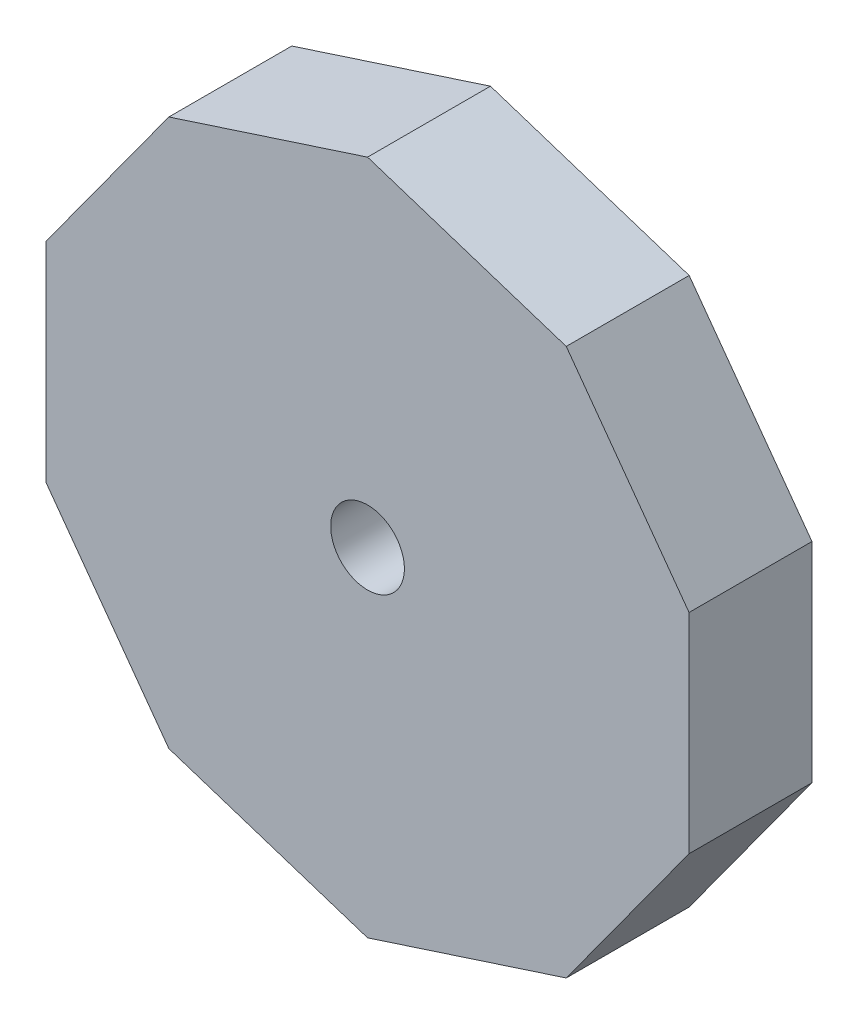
ISO-10303-21;
HEADER;
FILE_DESCRIPTION(('STEP AP214'),'2;1');
FILE_NAME('part.step','',(''),(''),'','','');
FILE_SCHEMA(('AUTOMOTIVE_DESIGN { 1 0 10303 214 1 1 1 1 }'));
ENDSEC;
DATA;
#1=APPLICATION_CONTEXT('core data for automotive mechanical design processes');
#2=APPLICATION_PROTOCOL_DEFINITION('international standard','automotive_design',2000,#1);
#3=PRODUCT_CONTEXT('',#1,'mechanical');
#4=PRODUCT('Part','Part','',(#3));
#5=PRODUCT_RELATED_PRODUCT_CATEGORY('part','',(#4));
#6=PRODUCT_DEFINITION_FORMATION('','',#4);
#7=PRODUCT_DEFINITION_CONTEXT('part definition',#1,'design');
#8=PRODUCT_DEFINITION('design','',#6,#7);
#9=PRODUCT_DEFINITION_SHAPE('','',#8);
#10=(LENGTH_UNIT() NAMED_UNIT(*) SI_UNIT(.MILLI.,.METRE.));
#11=(NAMED_UNIT(*) PLANE_ANGLE_UNIT() SI_UNIT($,.RADIAN.));
#12=(NAMED_UNIT(*) SI_UNIT($,.STERADIAN.) SOLID_ANGLE_UNIT());
#13=UNCERTAINTY_MEASURE_WITH_UNIT(LENGTH_MEASURE(1.E-05),#10,'distance_accuracy_value','');
#14=(GEOMETRIC_REPRESENTATION_CONTEXT(3) GLOBAL_UNCERTAINTY_ASSIGNED_CONTEXT((#13)) GLOBAL_UNIT_ASSIGNED_CONTEXT((#10,
#11,#12)) REPRESENTATION_CONTEXT('',''));
#15=CARTESIAN_POINT('',(0.,0.,0.));
#16=DIRECTION('',(0.,0.,1.));
#17=DIRECTION('',(1.,0.,0.));
#18=AXIS2_PLACEMENT_3D('',#15,#16,#17);
#19=CARTESIAN_POINT('',(0.,0.,20.));
#20=DIRECTION('',(0.,0.,1.));
#21=DIRECTION('',(1.,0.,0.));
#22=AXIS2_PLACEMENT_3D('',#19,#20,#21);
#23=PLANE('',#22);
#24=DIRECTION('',(0.,1.,0.));
#25=VECTOR('',#24,1.);
#26=CARTESIAN_POINT('',(52.3206201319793,-17.,20.));
#27=LINE('',#26,#25);
#28=CARTESIAN_POINT('',(52.3206201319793,-17.,20.));
#29=VERTEX_POINT('',#28);
#30=CARTESIAN_POINT('',(52.3206201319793,17.,20.));
#31=VERTEX_POINT('',#30);
#32=EDGE_CURVE('E164',#29,#31,#27,.T.);
#33=ORIENTED_EDGE('',*,*,#32,.T.);
#34=DIRECTION('',(-0.587785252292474,0.809016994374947,0.));
#35=VECTOR('',#34,1.);
#36=CARTESIAN_POINT('',(52.3206201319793,17.,20.));
#37=LINE('',#36,#35);
#38=CARTESIAN_POINT('',(32.3359215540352,44.5065778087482,20.));
#39=VERTEX_POINT('',#38);
#40=EDGE_CURVE('E102',#31,#39,#37,.T.);
#41=ORIENTED_EDGE('',*,*,#40,.T.);
#42=DIRECTION('',(-0.951056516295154,0.309016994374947,0.));
#43=VECTOR('',#42,1.);
#44=CARTESIAN_POINT('',(32.3359215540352,44.5065778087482,20.));
#45=LINE('',#44,#43);
#46=CARTESIAN_POINT('',(0.,55.0131556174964,20.));
#47=VERTEX_POINT('',#46);
#48=EDGE_CURVE('E185',#39,#47,#45,.T.);
#49=ORIENTED_EDGE('',*,*,#48,.T.);
#50=DIRECTION('',(-0.951056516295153,-0.309016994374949,0.));
#51=VECTOR('',#50,1.);
#52=CARTESIAN_POINT('',(0.,55.0131556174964,20.));
#53=LINE('',#52,#51);
#54=CARTESIAN_POINT('',(-32.3359215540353,44.5065778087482,20.));
#55=VERTEX_POINT('',#54);
#56=EDGE_CURVE('E204',#47,#55,#53,.T.);
#57=ORIENTED_EDGE('',*,*,#56,.T.);
#58=DIRECTION('',(-0.587785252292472,-0.809016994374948,0.));
#59=VECTOR('',#58,1.);
#60=CARTESIAN_POINT('',(-32.3359215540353,44.5065778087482,20.));
#61=LINE('',#60,#59);
#62=CARTESIAN_POINT('',(-52.3206201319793,17.,20.));
#63=VERTEX_POINT('',#62);
#64=EDGE_CURVE('E201',#55,#63,#61,.T.);
#65=ORIENTED_EDGE('',*,*,#64,.T.);
#66=DIRECTION('',(0.,-1.,0.));
#67=VECTOR('',#66,1.);
#68=CARTESIAN_POINT('',(-52.3206201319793,17.,20.));
#69=LINE('',#68,#67);
#70=CARTESIAN_POINT('',(-52.3206201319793,-17.0000000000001,20.));
#71=VERTEX_POINT('',#70);
#72=EDGE_CURVE('E203',#63,#71,#69,.T.);
#73=ORIENTED_EDGE('',*,*,#72,.T.);
#74=DIRECTION('',(0.587785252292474,-0.809016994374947,0.));
#75=VECTOR('',#74,1.);
#76=CARTESIAN_POINT('',(-52.3206201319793,-17.0000000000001,20.));
#77=LINE('',#76,#75);
#78=CARTESIAN_POINT('',(-32.3359215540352,-44.5065778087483,20.));
#79=VERTEX_POINT('',#78);
#80=EDGE_CURVE('E127',#71,#79,#77,.T.);
#81=ORIENTED_EDGE('',*,*,#80,.T.);
#82=DIRECTION('',(0.951056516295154,-0.309016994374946,0.));
#83=VECTOR('',#82,1.);
#84=CARTESIAN_POINT('',(-32.3359215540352,-44.5065778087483,20.));
#85=LINE('',#84,#83);
#86=CARTESIAN_POINT('',(0.,-55.0131556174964,20.));
#87=VERTEX_POINT('',#86);
#88=EDGE_CURVE('E121',#79,#87,#85,.T.);
#89=ORIENTED_EDGE('',*,*,#88,.T.);
#90=DIRECTION('',(0.951056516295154,0.309016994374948,0.));
#91=VECTOR('',#90,1.);
#92=CARTESIAN_POINT('',(0.,-55.0131556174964,20.));
#93=LINE('',#92,#91);
#94=CARTESIAN_POINT('',(32.3359215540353,-44.5065778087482,20.));
#95=VERTEX_POINT('',#94);
#96=EDGE_CURVE('E125',#87,#95,#93,.T.);
#97=ORIENTED_EDGE('',*,*,#96,.T.);
#98=DIRECTION('',(0.587785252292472,0.809016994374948,0.));
#99=VECTOR('',#98,1.);
#100=CARTESIAN_POINT('',(32.3359215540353,-44.5065778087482,20.));
#101=LINE('',#100,#99);
#102=EDGE_CURVE('E53',#95,#29,#101,.T.);
#103=ORIENTED_EDGE('',*,*,#102,.T.);
#104=EDGE_LOOP('',(#33,#41,#49,#57,#65,#73,#81,#89,#97,#103));
#105=FACE_BOUND('',#104,.T.);
#106=CARTESIAN_POINT('',(0.,0.,20.));
#107=DIRECTION('',(0.,0.,1.));
#108=DIRECTION('',(1.,0.,0.));
#109=AXIS2_PLACEMENT_3D('',#106,#107,#108);
#110=CIRCLE('',#109,6.);
#111=CARTESIAN_POINT('',(6.,0.,20.));
#112=VERTEX_POINT('',#111);
#113=EDGE_CURVE('E149',#112,#112,#110,.T.);
#114=ORIENTED_EDGE('',*,*,#113,.F.);
#115=EDGE_LOOP('',(#114));
#116=FACE_BOUND('',#115,.T.);
#117=ADVANCED_FACE('F36',(#105,#116),#23,.T.);
#118=CARTESIAN_POINT('',(0.,0.,0.));
#119=DIRECTION('',(0.,0.,1.));
#120=DIRECTION('',(1.,0.,0.));
#121=AXIS2_PLACEMENT_3D('',#118,#119,#120);
#122=PLANE('',#121);
#123=DIRECTION('',(0.,1.,0.));
#124=VECTOR('',#123,1.);
#125=CARTESIAN_POINT('',(52.3206201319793,-17.,0.));
#126=LINE('',#125,#124);
#127=CARTESIAN_POINT('',(52.3206201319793,-17.,0.));
#128=VERTEX_POINT('',#127);
#129=CARTESIAN_POINT('',(52.3206201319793,17.,0.));
#130=VERTEX_POINT('',#129);
#131=EDGE_CURVE('E145',#128,#130,#126,.T.);
#132=ORIENTED_EDGE('',*,*,#131,.F.);
#133=DIRECTION('',(0.587785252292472,0.809016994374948,0.));
#134=VECTOR('',#133,1.);
#135=CARTESIAN_POINT('',(32.3359215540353,-44.5065778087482,0.));
#136=LINE('',#135,#134);
#137=CARTESIAN_POINT('',(32.3359215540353,-44.5065778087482,0.));
#138=VERTEX_POINT('',#137);
#139=EDGE_CURVE('E94',#138,#128,#136,.T.);
#140=ORIENTED_EDGE('',*,*,#139,.F.);
#141=DIRECTION('',(0.951056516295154,0.309016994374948,0.));
#142=VECTOR('',#141,1.);
#143=CARTESIAN_POINT('',(0.,-55.0131556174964,0.));
#144=LINE('',#143,#142);
#145=CARTESIAN_POINT('',(0.,-55.0131556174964,0.));
#146=VERTEX_POINT('',#145);
#147=EDGE_CURVE('E88',#146,#138,#144,.T.);
#148=ORIENTED_EDGE('',*,*,#147,.F.);
#149=DIRECTION('',(0.951056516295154,-0.309016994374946,0.));
#150=VECTOR('',#149,1.);
#151=CARTESIAN_POINT('',(-32.3359215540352,-44.5065778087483,0.));
#152=LINE('',#151,#150);
#153=CARTESIAN_POINT('',(-32.3359215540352,-44.5065778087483,0.));
#154=VERTEX_POINT('',#153);
#155=EDGE_CURVE('E135',#154,#146,#152,.T.);
#156=ORIENTED_EDGE('',*,*,#155,.F.);
#157=DIRECTION('',(0.587785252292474,-0.809016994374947,0.));
#158=VECTOR('',#157,1.);
#159=CARTESIAN_POINT('',(-52.3206201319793,-17.0000000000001,0.));
#160=LINE('',#159,#158);
#161=CARTESIAN_POINT('',(-52.3206201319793,-17.0000000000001,0.));
#162=VERTEX_POINT('',#161);
#163=EDGE_CURVE('E159',#162,#154,#160,.T.);
#164=ORIENTED_EDGE('',*,*,#163,.F.);
#165=DIRECTION('',(0.,-1.,0.));
#166=VECTOR('',#165,1.);
#167=CARTESIAN_POINT('',(-52.3206201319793,17.,0.));
#168=LINE('',#167,#166);
#169=CARTESIAN_POINT('',(-52.3206201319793,17.,0.));
#170=VERTEX_POINT('',#169);
#171=EDGE_CURVE('E157',#170,#162,#168,.T.);
#172=ORIENTED_EDGE('',*,*,#171,.F.);
#173=DIRECTION('',(-0.587785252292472,-0.809016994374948,0.));
#174=VECTOR('',#173,1.);
#175=CARTESIAN_POINT('',(-32.3359215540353,44.5065778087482,0.));
#176=LINE('',#175,#174);
#177=CARTESIAN_POINT('',(-32.3359215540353,44.5065778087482,0.));
#178=VERTEX_POINT('',#177);
#179=EDGE_CURVE('E155',#178,#170,#176,.T.);
#180=ORIENTED_EDGE('',*,*,#179,.F.);
#181=DIRECTION('',(-0.951056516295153,-0.309016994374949,0.));
#182=VECTOR('',#181,1.);
#183=CARTESIAN_POINT('',(0.,55.0131556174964,0.));
#184=LINE('',#183,#182);
#185=CARTESIAN_POINT('',(0.,55.0131556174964,0.));
#186=VERTEX_POINT('',#185);
#187=EDGE_CURVE('E153',#186,#178,#184,.T.);
#188=ORIENTED_EDGE('',*,*,#187,.F.);
#189=DIRECTION('',(-0.951056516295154,0.309016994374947,0.));
#190=VECTOR('',#189,1.);
#191=CARTESIAN_POINT('',(32.3359215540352,44.5065778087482,0.));
#192=LINE('',#191,#190);
#193=CARTESIAN_POINT('',(32.3359215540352,44.5065778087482,0.));
#194=VERTEX_POINT('',#193);
#195=EDGE_CURVE('E151',#194,#186,#192,.T.);
#196=ORIENTED_EDGE('',*,*,#195,.F.);
#197=DIRECTION('',(-0.587785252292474,0.809016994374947,0.));
#198=VECTOR('',#197,1.);
#199=CARTESIAN_POINT('',(52.3206201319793,17.,0.));
#200=LINE('',#199,#198);
#201=EDGE_CURVE('E148',#130,#194,#200,.T.);
#202=ORIENTED_EDGE('',*,*,#201,.F.);
#203=EDGE_LOOP('',(#132,#140,#148,#156,#164,#172,#180,#188,#196,#202));
#204=FACE_BOUND('',#203,.T.);
#205=CARTESIAN_POINT('',(0.,0.,0.));
#206=DIRECTION('',(0.,0.,1.));
#207=DIRECTION('',(1.,0.,0.));
#208=AXIS2_PLACEMENT_3D('',#205,#206,#207);
#209=CIRCLE('',#208,6.);
#210=CARTESIAN_POINT('',(6.,0.,0.));
#211=VERTEX_POINT('',#210);
#212=EDGE_CURVE('E212',#211,#211,#209,.T.);
#213=ORIENTED_EDGE('',*,*,#212,.T.);
#214=EDGE_LOOP('',(#213));
#215=FACE_BOUND('',#214,.T.);
#216=ADVANCED_FACE('F189',(#204,#215),#122,.F.);
#217=CARTESIAN_POINT('',(52.3206201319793,-17.,20.));
#218=DIRECTION('',(-1.,0.,0.));
#219=DIRECTION('',(0.,-1.,0.));
#220=AXIS2_PLACEMENT_3D('',#217,#218,#219);
#221=PLANE('',#220);
#222=ORIENTED_EDGE('',*,*,#131,.T.);
#223=DIRECTION('',(0.,0.,-1.));
#224=VECTOR('',#223,1.);
#225=CARTESIAN_POINT('',(52.3206201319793,17.,20.));
#226=LINE('',#225,#224);
#227=EDGE_CURVE('E11',#31,#130,#226,.T.);
#228=ORIENTED_EDGE('',*,*,#227,.F.);
#229=ORIENTED_EDGE('',*,*,#32,.F.);
#230=DIRECTION('',(0.,0.,-1.));
#231=VECTOR('',#230,1.);
#232=CARTESIAN_POINT('',(52.3206201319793,-17.,20.));
#233=LINE('',#232,#231);
#234=EDGE_CURVE('E141',#29,#128,#233,.T.);
#235=ORIENTED_EDGE('',*,*,#234,.T.);
#236=EDGE_LOOP('',(#222,#228,#229,#235));
#237=FACE_BOUND('',#236,.T.);
#238=ADVANCED_FACE('F38',(#237),#221,.F.);
#239=CARTESIAN_POINT('',(52.3206201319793,17.,20.));
#240=DIRECTION('',(-0.809016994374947,-0.587785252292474,0.));
#241=DIRECTION('',(0.587785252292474,-0.809016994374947,0.));
#242=AXIS2_PLACEMENT_3D('',#239,#240,#241);
#243=PLANE('',#242);
#244=ORIENTED_EDGE('',*,*,#201,.T.);
#245=DIRECTION('',(0.,0.,-1.));
#246=VECTOR('',#245,1.);
#247=CARTESIAN_POINT('',(32.3359215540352,44.5065778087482,20.));
#248=LINE('',#247,#246);
#249=EDGE_CURVE('E45',#39,#194,#248,.T.);
#250=ORIENTED_EDGE('',*,*,#249,.F.);
#251=ORIENTED_EDGE('',*,*,#40,.F.);
#252=ORIENTED_EDGE('',*,*,#227,.T.);
#253=EDGE_LOOP('',(#244,#250,#251,#252));
#254=FACE_BOUND('',#253,.T.);
#255=ADVANCED_FACE('F248',(#254),#243,.F.);
#256=CARTESIAN_POINT('',(32.3359215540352,44.5065778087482,20.));
#257=DIRECTION('',(-0.309016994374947,-0.951056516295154,0.));
#258=DIRECTION('',(0.951056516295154,-0.309016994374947,0.));
#259=AXIS2_PLACEMENT_3D('',#256,#257,#258);
#260=PLANE('',#259);
#261=ORIENTED_EDGE('',*,*,#195,.T.);
#262=DIRECTION('',(0.,0.,-1.));
#263=VECTOR('',#262,1.);
#264=CARTESIAN_POINT('',(0.,55.0131556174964,20.));
#265=LINE('',#264,#263);
#266=EDGE_CURVE('E177',#47,#186,#265,.T.);
#267=ORIENTED_EDGE('',*,*,#266,.F.);
#268=ORIENTED_EDGE('',*,*,#48,.F.);
#269=ORIENTED_EDGE('',*,*,#249,.T.);
#270=EDGE_LOOP('',(#261,#267,#268,#269));
#271=FACE_BOUND('',#270,.T.);
#272=ADVANCED_FACE('F183',(#271),#260,.F.);
#273=CARTESIAN_POINT('',(0.,55.0131556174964,20.));
#274=DIRECTION('',(0.309016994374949,-0.951056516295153,0.));
#275=DIRECTION('',(0.951056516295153,0.309016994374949,0.));
#276=AXIS2_PLACEMENT_3D('',#273,#274,#275);
#277=PLANE('',#276);
#278=ORIENTED_EDGE('',*,*,#187,.T.);
#279=DIRECTION('',(0.,0.,-1.));
#280=VECTOR('',#279,1.);
#281=CARTESIAN_POINT('',(-32.3359215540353,44.5065778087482,20.));
#282=LINE('',#281,#280);
#283=EDGE_CURVE('E174',#55,#178,#282,.T.);
#284=ORIENTED_EDGE('',*,*,#283,.F.);
#285=ORIENTED_EDGE('',*,*,#56,.F.);
#286=ORIENTED_EDGE('',*,*,#266,.T.);
#287=EDGE_LOOP('',(#278,#284,#285,#286));
#288=FACE_BOUND('',#287,.T.);
#289=ADVANCED_FACE('F195',(#288),#277,.F.);
#290=CARTESIAN_POINT('',(-32.3359215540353,44.5065778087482,20.));
#291=DIRECTION('',(0.809016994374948,-0.587785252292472,0.));
#292=DIRECTION('',(0.587785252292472,0.809016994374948,0.));
#293=AXIS2_PLACEMENT_3D('',#290,#291,#292);
#294=PLANE('',#293);
#295=ORIENTED_EDGE('',*,*,#179,.T.);
#296=DIRECTION('',(0.,0.,-1.));
#297=VECTOR('',#296,1.);
#298=CARTESIAN_POINT('',(-52.3206201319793,17.,20.));
#299=LINE('',#298,#297);
#300=EDGE_CURVE('E171',#63,#170,#299,.T.);
#301=ORIENTED_EDGE('',*,*,#300,.F.);
#302=ORIENTED_EDGE('',*,*,#64,.F.);
#303=ORIENTED_EDGE('',*,*,#283,.T.);
#304=EDGE_LOOP('',(#295,#301,#302,#303));
#305=FACE_BOUND('',#304,.T.);
#306=ADVANCED_FACE('F199',(#305),#294,.F.);
#307=CARTESIAN_POINT('',(-52.3206201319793,17.,20.));
#308=DIRECTION('',(1.,0.,0.));
#309=DIRECTION('',(0.,1.,0.));
#310=AXIS2_PLACEMENT_3D('',#307,#308,#309);
#311=PLANE('',#310);
#312=ORIENTED_EDGE('',*,*,#171,.T.);
#313=DIRECTION('',(0.,0.,-1.));
#314=VECTOR('',#313,1.);
#315=CARTESIAN_POINT('',(-52.3206201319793,-17.0000000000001,20.));
#316=LINE('',#315,#314);
#317=EDGE_CURVE('E168',#71,#162,#316,.T.);
#318=ORIENTED_EDGE('',*,*,#317,.F.);
#319=ORIENTED_EDGE('',*,*,#72,.F.);
#320=ORIENTED_EDGE('',*,*,#300,.T.);
#321=EDGE_LOOP('',(#312,#318,#319,#320));
#322=FACE_BOUND('',#321,.T.);
#323=ADVANCED_FACE('F238',(#322),#311,.F.);
#324=CARTESIAN_POINT('',(-52.3206201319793,-17.0000000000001,20.));
#325=DIRECTION('',(0.809016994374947,0.587785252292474,0.));
#326=DIRECTION('',(-0.587785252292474,0.809016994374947,0.));
#327=AXIS2_PLACEMENT_3D('',#324,#325,#326);
#328=PLANE('',#327);
#329=ORIENTED_EDGE('',*,*,#163,.T.);
#330=DIRECTION('',(0.,0.,-1.));
#331=VECTOR('',#330,1.);
#332=CARTESIAN_POINT('',(-32.3359215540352,-44.5065778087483,20.));
#333=LINE('',#332,#331);
#334=EDGE_CURVE('E136',#79,#154,#333,.T.);
#335=ORIENTED_EDGE('',*,*,#334,.F.);
#336=ORIENTED_EDGE('',*,*,#80,.F.);
#337=ORIENTED_EDGE('',*,*,#317,.T.);
#338=EDGE_LOOP('',(#329,#335,#336,#337));
#339=FACE_BOUND('',#338,.T.);
#340=ADVANCED_FACE('F235',(#339),#328,.F.);
#341=CARTESIAN_POINT('',(-32.3359215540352,-44.5065778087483,20.));
#342=DIRECTION('',(0.309016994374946,0.951056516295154,0.));
#343=DIRECTION('',(-0.951056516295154,0.309016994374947,0.));
#344=AXIS2_PLACEMENT_3D('',#341,#342,#343);
#345=PLANE('',#344);
#346=ORIENTED_EDGE('',*,*,#155,.T.);
#347=DIRECTION('',(0.,0.,-1.));
#348=VECTOR('',#347,1.);
#349=CARTESIAN_POINT('',(0.,-55.0131556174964,20.));
#350=LINE('',#349,#348);
#351=EDGE_CURVE('E132',#87,#146,#350,.T.);
#352=ORIENTED_EDGE('',*,*,#351,.F.);
#353=ORIENTED_EDGE('',*,*,#88,.F.);
#354=ORIENTED_EDGE('',*,*,#334,.T.);
#355=EDGE_LOOP('',(#346,#352,#353,#354));
#356=FACE_BOUND('',#355,.T.);
#357=ADVANCED_FACE('F133',(#356),#345,.F.);
#358=CARTESIAN_POINT('',(0.,-55.0131556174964,20.));
#359=DIRECTION('',(-0.309016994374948,0.951056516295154,0.));
#360=DIRECTION('',(-0.951056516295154,-0.309016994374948,0.));
#361=AXIS2_PLACEMENT_3D('',#358,#359,#360);
#362=PLANE('',#361);
#363=ORIENTED_EDGE('',*,*,#147,.T.);
#364=DIRECTION('',(0.,0.,-1.));
#365=VECTOR('',#364,1.);
#366=CARTESIAN_POINT('',(32.3359215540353,-44.5065778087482,20.));
#367=LINE('',#366,#365);
#368=EDGE_CURVE('E137',#95,#138,#367,.T.);
#369=ORIENTED_EDGE('',*,*,#368,.F.);
#370=ORIENTED_EDGE('',*,*,#96,.F.);
#371=ORIENTED_EDGE('',*,*,#351,.T.);
#372=EDGE_LOOP('',(#363,#369,#370,#371));
#373=FACE_BOUND('',#372,.T.);
#374=ADVANCED_FACE('F139',(#373),#362,.F.);
#375=CARTESIAN_POINT('',(32.3359215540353,-44.5065778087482,20.));
#376=DIRECTION('',(-0.809016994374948,0.587785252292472,0.));
#377=DIRECTION('',(-0.587785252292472,-0.809016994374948,0.));
#378=AXIS2_PLACEMENT_3D('',#375,#376,#377);
#379=PLANE('',#378);
#380=ORIENTED_EDGE('',*,*,#139,.T.);
#381=ORIENTED_EDGE('',*,*,#234,.F.);
#382=ORIENTED_EDGE('',*,*,#102,.F.);
#383=ORIENTED_EDGE('',*,*,#368,.T.);
#384=EDGE_LOOP('',(#380,#381,#382,#383));
#385=FACE_BOUND('',#384,.T.);
#386=ADVANCED_FACE('F228',(#385),#379,.F.);
#387=CARTESIAN_POINT('',(0.,0.,20.));
#388=DIRECTION('',(0.,0.,-1.));
#389=DIRECTION('',(-1.,0.,0.));
#390=AXIS2_PLACEMENT_3D('',#387,#388,#389);
#391=CYLINDRICAL_SURFACE('',#390,6.);
#392=ORIENTED_EDGE('',*,*,#113,.T.);
#393=EDGE_LOOP('',(#392));
#394=FACE_BOUND('',#393,.T.);
#395=ORIENTED_EDGE('',*,*,#212,.F.);
#396=EDGE_LOOP('',(#395));
#397=FACE_BOUND('',#396,.T.);
#398=ADVANCED_FACE('F218',(#394,#397),#391,.F.);
#399=CLOSED_SHELL('',(#117,#216,#238,#255,#272,#289,#306,#323,#340,#357,#374,#386,#398));
#400=MANIFOLD_SOLID_BREP('B2',#399);
#401=ADVANCED_BREP_SHAPE_REPRESENTATION('',(#18,#400),#14);
#402=SHAPE_DEFINITION_REPRESENTATION(#9,#401);
ENDSEC;
END-ISO-10303-21;
